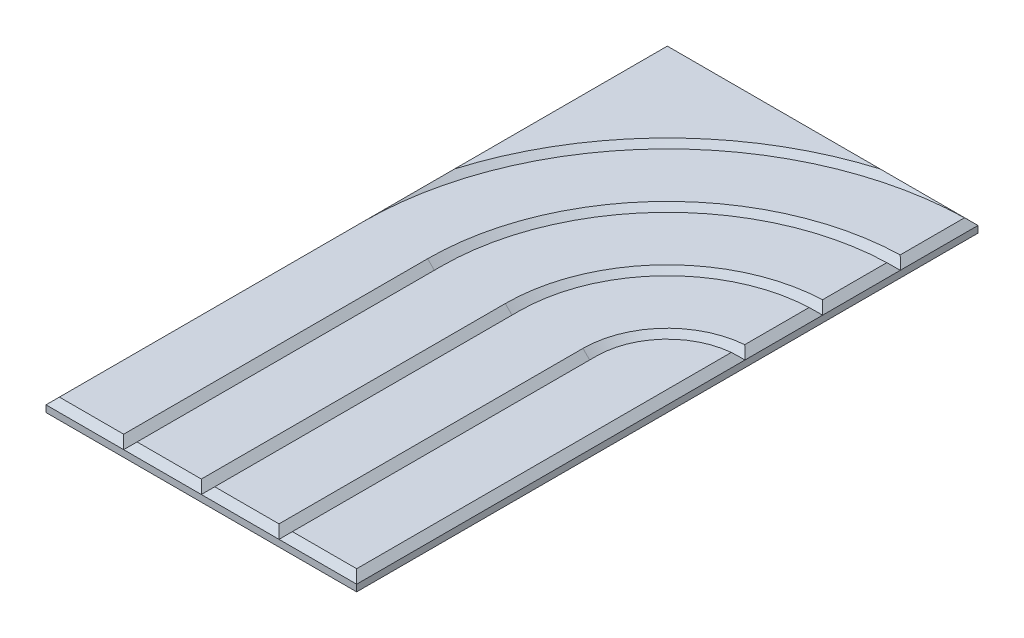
ISO-10303-21;
HEADER;
FILE_DESCRIPTION(('STEP AP214'),'2;1');
FILE_NAME('part.step','',(''),(''),'','','');
FILE_SCHEMA(('AUTOMOTIVE_DESIGN { 1 0 10303 214 1 1 1 1 }'));
ENDSEC;
DATA;
#1=APPLICATION_CONTEXT('core data for automotive mechanical design processes');
#2=APPLICATION_PROTOCOL_DEFINITION('international standard','automotive_design',2000,#1);
#3=PRODUCT_CONTEXT('',#1,'mechanical');
#4=PRODUCT('Part','Part','',(#3));
#5=PRODUCT_RELATED_PRODUCT_CATEGORY('part','',(#4));
#6=PRODUCT_DEFINITION_FORMATION('','',#4);
#7=PRODUCT_DEFINITION_CONTEXT('part definition',#1,'design');
#8=PRODUCT_DEFINITION('design','',#6,#7);
#9=PRODUCT_DEFINITION_SHAPE('','',#8);
#10=(LENGTH_UNIT() NAMED_UNIT(*) SI_UNIT(.MILLI.,.METRE.));
#11=(NAMED_UNIT(*) PLANE_ANGLE_UNIT() SI_UNIT($,.RADIAN.));
#12=(NAMED_UNIT(*) SI_UNIT($,.STERADIAN.) SOLID_ANGLE_UNIT());
#13=UNCERTAINTY_MEASURE_WITH_UNIT(LENGTH_MEASURE(1.E-05),#10,'distance_accuracy_value','');
#14=(GEOMETRIC_REPRESENTATION_CONTEXT(3) GLOBAL_UNCERTAINTY_ASSIGNED_CONTEXT((#13)) GLOBAL_UNIT_ASSIGNED_CONTEXT((#10,
#11,#12)) REPRESENTATION_CONTEXT('',''));
#15=CARTESIAN_POINT('',(0.,0.,0.));
#16=DIRECTION('',(0.,0.,1.));
#17=DIRECTION('',(1.,0.,0.));
#18=AXIS2_PLACEMENT_3D('',#15,#16,#17);
#19=CARTESIAN_POINT('',(290.,25.,580.));
#20=DIRECTION('',(-1.,0.,0.));
#21=DIRECTION('',(0.,0.,1.));
#22=AXIS2_PLACEMENT_3D('',#19,#20,#21);
#23=PLANE('',#22);
#24=DIRECTION('',(0.,-1.,0.));
#25=VECTOR('',#24,1.);
#26=CARTESIAN_POINT('',(290.,25.,-580.));
#27=LINE('',#26,#25);
#28=CARTESIAN_POINT('',(289.999991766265,12.5,-580.));
#29=VERTEX_POINT('',#28);
#30=CARTESIAN_POINT('',(290.,0.,-580.));
#31=VERTEX_POINT('',#30);
#32=EDGE_CURVE('E66',#29,#31,#27,.T.);
#33=ORIENTED_EDGE('',*,*,#32,.F.);
#34=DIRECTION('',(0.,0.,1.));
#35=VECTOR('',#34,1.);
#36=CARTESIAN_POINT('',(290.,12.4999999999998,580.));
#37=LINE('',#36,#35);
#38=CARTESIAN_POINT('',(290.,12.5,-435.));
#39=VERTEX_POINT('',#38);
#40=EDGE_CURVE('E269',#29,#39,#37,.T.);
#41=ORIENTED_EDGE('',*,*,#40,.T.);
#42=DIRECTION('',(0.,0.,1.));
#43=VECTOR('',#42,1.);
#44=CARTESIAN_POINT('',(290.,12.4999999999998,580.));
#45=LINE('',#44,#43);
#46=CARTESIAN_POINT('',(290.,12.5,-290.));
#47=VERTEX_POINT('',#46);
#48=EDGE_CURVE('E270',#39,#47,#45,.T.);
#49=ORIENTED_EDGE('',*,*,#48,.T.);
#50=DIRECTION('',(0.,0.,1.));
#51=VECTOR('',#50,1.);
#52=CARTESIAN_POINT('',(290.,12.4999999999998,580.));
#53=LINE('',#52,#51);
#54=CARTESIAN_POINT('',(290.,12.5,-145.));
#55=VERTEX_POINT('',#54);
#56=EDGE_CURVE('E442',#47,#55,#53,.T.);
#57=ORIENTED_EDGE('',*,*,#56,.T.);
#58=DIRECTION('',(0.,0.,1.));
#59=VECTOR('',#58,1.);
#60=CARTESIAN_POINT('',(290.,12.4999999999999,580.));
#61=LINE('',#60,#59);
#62=CARTESIAN_POINT('',(290.,12.4999999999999,580.));
#63=VERTEX_POINT('',#62);
#64=EDGE_CURVE('E131',#55,#63,#61,.T.);
#65=ORIENTED_EDGE('',*,*,#64,.T.);
#66=DIRECTION('',(0.,-1.,0.));
#67=VECTOR('',#66,1.);
#68=CARTESIAN_POINT('',(290.,25.,580.));
#69=LINE('',#68,#67);
#70=CARTESIAN_POINT('',(290.,0.,580.));
#71=VERTEX_POINT('',#70);
#72=EDGE_CURVE('E418',#63,#71,#69,.T.);
#73=ORIENTED_EDGE('',*,*,#72,.T.);
#74=DIRECTION('',(0.,0.,-1.));
#75=VECTOR('',#74,1.);
#76=CARTESIAN_POINT('',(290.,0.,580.));
#77=LINE('',#76,#75);
#78=EDGE_CURVE('E404',#71,#31,#77,.T.);
#79=ORIENTED_EDGE('',*,*,#78,.T.);
#80=EDGE_LOOP('',(#33,#41,#49,#57,#65,#73,#79));
#81=FACE_BOUND('',#80,.T.);
#82=ADVANCED_FACE('F33',(#81),#23,.F.);
#83=CARTESIAN_POINT('',(0.,25.,0.));
#84=DIRECTION('',(0.,-1.,0.));
#85=DIRECTION('',(0.,0.,-1.));
#86=AXIS2_PLACEMENT_3D('',#83,#84,#85);
#87=PLANE('',#86);
#88=DIRECTION('',(1.,0.,0.));
#89=VECTOR('',#88,1.);
#90=CARTESIAN_POINT('',(0.,25.,567.5));
#91=LINE('',#90,#89);
#92=CARTESIAN_POINT('',(157.5,25.,567.5));
#93=VERTEX_POINT('',#92);
#94=CARTESIAN_POINT('',(277.5,25.,567.5));
#95=VERTEX_POINT('',#94);
#96=EDGE_CURVE('E52',#93,#95,#91,.T.);
#97=ORIENTED_EDGE('',*,*,#96,.T.);
#98=DIRECTION('',(0.,0.,-1.));
#99=VECTOR('',#98,1.);
#100=CARTESIAN_POINT('',(277.5,25.,0.));
#101=LINE('',#100,#99);
#102=CARTESIAN_POINT('',(277.5,25.0000000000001,-131.909059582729));
#103=VERTEX_POINT('',#102);
#104=EDGE_CURVE('E129',#95,#103,#101,.T.);
#105=ORIENTED_EDGE('',*,*,#104,.T.);
#106=CARTESIAN_POINT('',(290.,25.0000000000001,1.11022302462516E-13));
#107=DIRECTION('',(0.,-1.,0.));
#108=DIRECTION('',(0.,0.,-1.));
#109=AXIS2_PLACEMENT_3D('',#106,#107,#108);
#110=CIRCLE('',#109,132.5);
#111=CARTESIAN_POINT('',(157.5,25.0000000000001,2.22044604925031E-13));
#112=VERTEX_POINT('',#111);
#113=EDGE_CURVE('E141',#112,#103,#110,.T.);
#114=ORIENTED_EDGE('',*,*,#113,.F.);
#115=DIRECTION('',(0.,0.,1.));
#116=VECTOR('',#115,1.);
#117=CARTESIAN_POINT('',(157.5,25.0000000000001,2.22044604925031E-13));
#118=LINE('',#117,#116);
#119=EDGE_CURVE('E522',#112,#93,#118,.T.);
#120=ORIENTED_EDGE('',*,*,#119,.T.);
#121=EDGE_LOOP('',(#97,#105,#114,#120));
#122=FACE_BOUND('',#121,.T.);
#123=ADVANCED_FACE('F139',(#122),#87,.F.);
#124=CARTESIAN_POINT('',(290.,25.0000000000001,1.11022302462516E-13));
#125=DIRECTION('',(0.,-1.,0.));
#126=DIRECTION('',(0.,0.,-1.));
#127=AXIS2_PLACEMENT_3D('',#124,#125,#126);
#128=CIRCLE('',#127,157.5);
#129=CARTESIAN_POINT('',(132.5,25.0000000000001,2.22044604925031E-13));
#130=VERTEX_POINT('',#129);
#131=CARTESIAN_POINT('',(277.5,25.0000000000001,-157.003184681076));
#132=VERTEX_POINT('',#131);
#133=EDGE_CURVE('E154',#130,#132,#128,.T.);
#134=ORIENTED_EDGE('',*,*,#133,.T.);
#135=DIRECTION('',(0.,0.,-1.));
#136=VECTOR('',#135,1.);
#137=CARTESIAN_POINT('',(277.5,25.,0.));
#138=LINE('',#137,#136);
#139=CARTESIAN_POINT('',(277.5,25.0000000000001,-277.218325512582));
#140=VERTEX_POINT('',#139);
#141=EDGE_CURVE('E324',#132,#140,#138,.T.);
#142=ORIENTED_EDGE('',*,*,#141,.T.);
#143=CARTESIAN_POINT('',(290.,25.0000000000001,1.11022302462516E-13));
#144=DIRECTION('',(0.,-1.,0.));
#145=DIRECTION('',(0.,0.,-1.));
#146=AXIS2_PLACEMENT_3D('',#143,#144,#145);
#147=CIRCLE('',#146,277.5);
#148=CARTESIAN_POINT('',(12.4999999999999,25.0000000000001,2.22044604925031E-13));
#149=VERTEX_POINT('',#148);
#150=EDGE_CURVE('E175',#149,#140,#147,.T.);
#151=ORIENTED_EDGE('',*,*,#150,.F.);
#152=DIRECTION('',(0.,0.,1.));
#153=VECTOR('',#152,1.);
#154=CARTESIAN_POINT('',(12.4999999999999,25.0000000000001,2.22044604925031E-13));
#155=LINE('',#154,#153);
#156=CARTESIAN_POINT('',(12.5,25.0000000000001,567.5));
#157=VERTEX_POINT('',#156);
#158=EDGE_CURVE('E161',#149,#157,#155,.T.);
#159=ORIENTED_EDGE('',*,*,#158,.T.);
#160=DIRECTION('',(1.,0.,0.));
#161=VECTOR('',#160,1.);
#162=CARTESIAN_POINT('',(0.,25.,567.5));
#163=LINE('',#162,#161);
#164=CARTESIAN_POINT('',(132.5,25.0000000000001,567.5));
#165=VERTEX_POINT('',#164);
#166=EDGE_CURVE('E301',#157,#165,#163,.T.);
#167=ORIENTED_EDGE('',*,*,#166,.T.);
#168=DIRECTION('',(0.,0.,1.));
#169=VECTOR('',#168,1.);
#170=CARTESIAN_POINT('',(132.5,25.0000000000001,2.22044604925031E-13));
#171=LINE('',#170,#169);
#172=EDGE_CURVE('E514',#130,#165,#171,.T.);
#173=ORIENTED_EDGE('',*,*,#172,.F.);
#174=EDGE_LOOP('',(#134,#142,#151,#159,#167,#173));
#175=FACE_BOUND('',#174,.T.);
#176=ADVANCED_FACE('F363',(#175),#87,.F.);
#177=CARTESIAN_POINT('',(290.,25.0000000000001,1.11022302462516E-13));
#178=DIRECTION('',(0.,-1.,0.));
#179=DIRECTION('',(0.,0.,-1.));
#180=AXIS2_PLACEMENT_3D('',#177,#178,#179);
#181=CIRCLE('',#180,302.5);
#182=CARTESIAN_POINT('',(-12.5000000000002,25.0000000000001,2.22044604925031E-13));
#183=VERTEX_POINT('',#182);
#184=CARTESIAN_POINT('',(277.5,25.0000000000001,-302.241625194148));
#185=VERTEX_POINT('',#184);
#186=EDGE_CURVE('E164',#183,#185,#181,.T.);
#187=ORIENTED_EDGE('',*,*,#186,.T.);
#188=DIRECTION('',(0.,0.,-1.));
#189=VECTOR('',#188,1.);
#190=CARTESIAN_POINT('',(277.5,25.,0.));
#191=LINE('',#190,#189);
#192=CARTESIAN_POINT('',(277.5,25.0000000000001,-422.315048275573));
#193=VERTEX_POINT('',#192);
#194=EDGE_CURVE('E295',#185,#193,#191,.T.);
#195=ORIENTED_EDGE('',*,*,#194,.T.);
#196=CARTESIAN_POINT('',(290.,25.0000000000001,1.11022302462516E-13));
#197=DIRECTION('',(0.,-1.,0.));
#198=DIRECTION('',(0.,0.,-1.));
#199=AXIS2_PLACEMENT_3D('',#196,#197,#198);
#200=CIRCLE('',#199,422.5);
#201=CARTESIAN_POINT('',(-132.5,25.0000000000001,2.22044604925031E-13));
#202=VERTEX_POINT('',#201);
#203=EDGE_CURVE('E199',#202,#193,#200,.T.);
#204=ORIENTED_EDGE('',*,*,#203,.F.);
#205=DIRECTION('',(0.,0.,1.));
#206=VECTOR('',#205,1.);
#207=CARTESIAN_POINT('',(-132.5,25.0000000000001,2.22044604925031E-13));
#208=LINE('',#207,#206);
#209=CARTESIAN_POINT('',(-132.5,25.,567.5));
#210=VERTEX_POINT('',#209);
#211=EDGE_CURVE('E185',#202,#210,#208,.T.);
#212=ORIENTED_EDGE('',*,*,#211,.T.);
#213=DIRECTION('',(1.,0.,0.));
#214=VECTOR('',#213,1.);
#215=CARTESIAN_POINT('',(0.,25.,567.5));
#216=LINE('',#215,#214);
#217=CARTESIAN_POINT('',(-12.5000000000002,25.0000000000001,567.5));
#218=VERTEX_POINT('',#217);
#219=EDGE_CURVE('E268',#210,#218,#216,.T.);
#220=ORIENTED_EDGE('',*,*,#219,.T.);
#221=DIRECTION('',(0.,0.,1.));
#222=VECTOR('',#221,1.);
#223=CARTESIAN_POINT('',(-12.5000000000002,25.0000000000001,2.22044604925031E-13));
#224=LINE('',#223,#222);
#225=EDGE_CURVE('E160',#183,#218,#224,.T.);
#226=ORIENTED_EDGE('',*,*,#225,.F.);
#227=EDGE_LOOP('',(#187,#195,#204,#212,#220,#226));
#228=FACE_BOUND('',#227,.T.);
#229=ADVANCED_FACE('F750',(#228),#87,.F.);
#230=CARTESIAN_POINT('',(290.,25.0000000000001,1.11022302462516E-13));
#231=DIRECTION('',(0.,-1.,0.));
#232=DIRECTION('',(0.,0.,-1.));
#233=AXIS2_PLACEMENT_3D('',#230,#231,#232);
#234=CIRCLE('',#233,447.5);
#235=CARTESIAN_POINT('',(-157.5,25.0000000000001,2.22044604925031E-13));
#236=VERTEX_POINT('',#235);
#237=CARTESIAN_POINT('',(277.5,25.0000000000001,-447.325384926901));
#238=VERTEX_POINT('',#237);
#239=EDGE_CURVE('E188',#236,#238,#234,.T.);
#240=ORIENTED_EDGE('',*,*,#239,.T.);
#241=DIRECTION('',(0.,0.,-1.));
#242=VECTOR('',#241,1.);
#243=CARTESIAN_POINT('',(277.5,25.,0.));
#244=LINE('',#243,#242);
#245=CARTESIAN_POINT('',(277.5,25.0000000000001,-567.362318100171));
#246=VERTEX_POINT('',#245);
#247=EDGE_CURVE('E488',#238,#246,#244,.T.);
#248=ORIENTED_EDGE('',*,*,#247,.T.);
#249=CARTESIAN_POINT('',(290.,25.0000000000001,1.11022302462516E-13));
#250=DIRECTION('',(0.,-1.,0.));
#251=DIRECTION('',(0.,0.,-1.));
#252=AXIS2_PLACEMENT_3D('',#249,#250,#251);
#253=CIRCLE('',#252,567.5);
#254=CARTESIAN_POINT('',(-277.5,25.0000000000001,2.22044604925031E-13));
#255=VERTEX_POINT('',#254);
#256=EDGE_CURVE('E210',#255,#246,#253,.T.);
#257=ORIENTED_EDGE('',*,*,#256,.F.);
#258=DIRECTION('',(0.,0.,1.));
#259=VECTOR('',#258,1.);
#260=CARTESIAN_POINT('',(-277.5,25.0000000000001,2.22044604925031E-13));
#261=LINE('',#260,#259);
#262=CARTESIAN_POINT('',(-277.5,25.0000000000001,567.5));
#263=VERTEX_POINT('',#262);
#264=EDGE_CURVE('E203',#255,#263,#261,.T.);
#265=ORIENTED_EDGE('',*,*,#264,.T.);
#266=DIRECTION('',(1.,0.,0.));
#267=VECTOR('',#266,1.);
#268=CARTESIAN_POINT('',(0.,25.,567.5));
#269=LINE('',#268,#267);
#270=CARTESIAN_POINT('',(-157.5,25.0000000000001,567.5));
#271=VERTEX_POINT('',#270);
#272=EDGE_CURVE('E490',#263,#271,#269,.T.);
#273=ORIENTED_EDGE('',*,*,#272,.T.);
#274=DIRECTION('',(0.,0.,1.));
#275=VECTOR('',#274,1.);
#276=CARTESIAN_POINT('',(-157.5,25.0000000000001,2.22044604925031E-13));
#277=LINE('',#276,#275);
#278=EDGE_CURVE('E184',#236,#271,#277,.T.);
#279=ORIENTED_EDGE('',*,*,#278,.F.);
#280=EDGE_LOOP('',(#240,#248,#257,#265,#273,#279));
#281=FACE_BOUND('',#280,.T.);
#282=ADVANCED_FACE('F371',(#281),#87,.F.);
#283=CARTESIAN_POINT('',(-290.,25.,-580.));
#284=DIRECTION('',(0.,0.,1.));
#285=DIRECTION('',(1.,0.,0.));
#286=AXIS2_PLACEMENT_3D('',#283,#284,#285);
#287=PLANE('',#286);
#288=DIRECTION('',(0.,-1.,0.));
#289=VECTOR('',#288,1.);
#290=CARTESIAN_POINT('',(-290.,25.,-580.));
#291=LINE('',#290,#289);
#292=CARTESIAN_POINT('',(-290.,12.4999999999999,-580.));
#293=VERTEX_POINT('',#292);
#294=CARTESIAN_POINT('',(-290.,0.,-580.));
#295=VERTEX_POINT('',#294);
#296=EDGE_CURVE('E423',#293,#295,#291,.T.);
#297=ORIENTED_EDGE('',*,*,#296,.F.);
#298=DIRECTION('',(1.,0.,0.));
#299=VECTOR('',#298,1.);
#300=CARTESIAN_POINT('',(-290.,12.4999999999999,-580.));
#301=LINE('',#300,#299);
#302=EDGE_CURVE('E436',#293,#29,#301,.T.);
#303=ORIENTED_EDGE('',*,*,#302,.T.);
#304=ORIENTED_EDGE('',*,*,#32,.T.);
#305=DIRECTION('',(-1.,0.,0.));
#306=VECTOR('',#305,1.);
#307=CARTESIAN_POINT('',(-290.,0.,-580.));
#308=LINE('',#307,#306);
#309=EDGE_CURVE('E405',#31,#295,#308,.T.);
#310=ORIENTED_EDGE('',*,*,#309,.T.);
#311=EDGE_LOOP('',(#297,#303,#304,#310));
#312=FACE_BOUND('',#311,.T.);
#313=ADVANCED_FACE('F367',(#312),#287,.F.);
#314=CARTESIAN_POINT('',(-290.,25.,580.));
#315=DIRECTION('',(1.,0.,0.));
#316=DIRECTION('',(0.,0.,-1.));
#317=AXIS2_PLACEMENT_3D('',#314,#315,#316);
#318=PLANE('',#317);
#319=DIRECTION('',(0.,0.,1.));
#320=VECTOR('',#319,1.);
#321=CARTESIAN_POINT('',(-290.,12.5,2.22044604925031E-13));
#322=LINE('',#321,#320);
#323=CARTESIAN_POINT('',(-290.,12.5,-8.23344728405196E-06));
#324=VERTEX_POINT('',#323);
#325=CARTESIAN_POINT('',(-290.,12.5,580.));
#326=VERTEX_POINT('',#325);
#327=EDGE_CURVE('E207',#324,#326,#322,.T.);
#328=ORIENTED_EDGE('',*,*,#327,.F.);
#329=DIRECTION('',(0.,0.,-1.));
#330=VECTOR('',#329,1.);
#331=CARTESIAN_POINT('',(-290.,12.4999999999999,580.));
#332=LINE('',#331,#330);
#333=EDGE_CURVE('E571',#324,#293,#332,.T.);
#334=ORIENTED_EDGE('',*,*,#333,.T.);
#335=ORIENTED_EDGE('',*,*,#296,.T.);
#336=DIRECTION('',(0.,0.,1.));
#337=VECTOR('',#336,1.);
#338=CARTESIAN_POINT('',(-290.,0.,580.));
#339=LINE('',#338,#337);
#340=CARTESIAN_POINT('',(-290.,0.,580.));
#341=VERTEX_POINT('',#340);
#342=EDGE_CURVE('E410',#295,#341,#339,.T.);
#343=ORIENTED_EDGE('',*,*,#342,.T.);
#344=DIRECTION('',(0.,-1.,0.));
#345=VECTOR('',#344,1.);
#346=CARTESIAN_POINT('',(-290.,25.,580.));
#347=LINE('',#346,#345);
#348=EDGE_CURVE('E420',#326,#341,#347,.T.);
#349=ORIENTED_EDGE('',*,*,#348,.F.);
#350=EDGE_LOOP('',(#328,#334,#335,#343,#349));
#351=FACE_BOUND('',#350,.T.);
#352=ADVANCED_FACE('F370',(#351),#318,.F.);
#353=DIRECTION('',(-1.,0.,0.));
#354=VECTOR('',#353,1.);
#355=CARTESIAN_POINT('',(0.,25.,-567.5));
#356=LINE('',#355,#354);
#357=CARTESIAN_POINT('',(119.706136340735,25.,-567.5));
#358=VERTEX_POINT('',#357);
#359=CARTESIAN_POINT('',(-277.5,25.,-567.5));
#360=VERTEX_POINT('',#359);
#361=EDGE_CURVE('E78',#358,#360,#356,.T.);
#362=ORIENTED_EDGE('',*,*,#361,.T.);
#363=DIRECTION('',(0.,0.,1.));
#364=VECTOR('',#363,1.);
#365=CARTESIAN_POINT('',(-277.5,25.,0.));
#366=LINE('',#365,#364);
#367=CARTESIAN_POINT('',(-277.5,25.,-170.293863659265));
#368=VERTEX_POINT('',#367);
#369=EDGE_CURVE('E216',#360,#368,#366,.T.);
#370=ORIENTED_EDGE('',*,*,#369,.T.);
#371=CARTESIAN_POINT('',(290.,25.,1.11022302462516E-13));
#372=DIRECTION('',(0.,-1.,0.));
#373=DIRECTION('',(0.,0.,-1.));
#374=AXIS2_PLACEMENT_3D('',#371,#372,#373);
#375=CIRCLE('',#374,592.5);
#376=EDGE_CURVE('E426',#358,#368,#375,.F.);
#377=ORIENTED_EDGE('',*,*,#376,.F.);
#378=EDGE_LOOP('',(#362,#370,#377));
#379=FACE_BOUND('',#378,.T.);
#380=ADVANCED_FACE('F365',(#379),#87,.F.);
#381=CARTESIAN_POINT('',(-290.,25.,580.));
#382=DIRECTION('',(0.,0.,-1.));
#383=DIRECTION('',(-1.,0.,0.));
#384=AXIS2_PLACEMENT_3D('',#381,#382,#383);
#385=PLANE('',#384);
#386=ORIENTED_EDGE('',*,*,#72,.F.);
#387=DIRECTION('',(-1.,0.,0.));
#388=VECTOR('',#387,1.);
#389=CARTESIAN_POINT('',(-290.,12.4999999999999,580.));
#390=LINE('',#389,#388);
#391=CARTESIAN_POINT('',(145.,12.5,580.));
#392=VERTEX_POINT('',#391);
#393=EDGE_CURVE('E461',#63,#392,#390,.T.);
#394=ORIENTED_EDGE('',*,*,#393,.T.);
#395=DIRECTION('',(-1.,0.,0.));
#396=VECTOR('',#395,1.);
#397=CARTESIAN_POINT('',(-290.,12.4999999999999,580.));
#398=LINE('',#397,#396);
#399=CARTESIAN_POINT('',(0.,12.5,580.));
#400=VERTEX_POINT('',#399);
#401=EDGE_CURVE('E468',#392,#400,#398,.T.);
#402=ORIENTED_EDGE('',*,*,#401,.T.);
#403=DIRECTION('',(-1.,0.,0.));
#404=VECTOR('',#403,1.);
#405=CARTESIAN_POINT('',(-290.,12.4999999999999,580.));
#406=LINE('',#405,#404);
#407=CARTESIAN_POINT('',(-145.,12.5,580.));
#408=VERTEX_POINT('',#407);
#409=EDGE_CURVE('E472',#400,#408,#406,.T.);
#410=ORIENTED_EDGE('',*,*,#409,.T.);
#411=DIRECTION('',(-1.,0.,0.));
#412=VECTOR('',#411,1.);
#413=CARTESIAN_POINT('',(-290.,12.4999999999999,580.));
#414=LINE('',#413,#412);
#415=EDGE_CURVE('E136',#408,#326,#414,.T.);
#416=ORIENTED_EDGE('',*,*,#415,.T.);
#417=ORIENTED_EDGE('',*,*,#348,.T.);
#418=DIRECTION('',(1.,0.,0.));
#419=VECTOR('',#418,1.);
#420=CARTESIAN_POINT('',(-290.,0.,580.));
#421=LINE('',#420,#419);
#422=EDGE_CURVE('E415',#341,#71,#421,.T.);
#423=ORIENTED_EDGE('',*,*,#422,.T.);
#424=EDGE_LOOP('',(#386,#394,#402,#410,#416,#417,#423));
#425=FACE_BOUND('',#424,.T.);
#426=ADVANCED_FACE('F376',(#425),#385,.F.);
#427=CARTESIAN_POINT('',(0.,0.,0.));
#428=DIRECTION('',(0.,-1.,0.));
#429=DIRECTION('',(0.,0.,-1.));
#430=AXIS2_PLACEMENT_3D('',#427,#428,#429);
#431=PLANE('',#430);
#432=ORIENTED_EDGE('',*,*,#78,.F.);
#433=ORIENTED_EDGE('',*,*,#422,.F.);
#434=ORIENTED_EDGE('',*,*,#342,.F.);
#435=ORIENTED_EDGE('',*,*,#309,.F.);
#436=EDGE_LOOP('',(#432,#433,#434,#435));
#437=FACE_BOUND('',#436,.T.);
#438=ADVANCED_FACE('F379',(#437),#431,.T.);
#439=CARTESIAN_POINT('',(290.,25.0000000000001,1.11022302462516E-13));
#440=DIRECTION('',(0.,1.,0.));
#441=DIRECTION('',(0.,0.,1.));
#442=AXIS2_PLACEMENT_3D('',#439,#440,#441);
#443=CONICAL_SURFACE('',#442,592.5,0.785398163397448);
#444=ORIENTED_EDGE('',*,*,#376,.T.);
#445=CARTESIAN_POINT('',(-277.5,25.,-170.293863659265));
#446=CARTESIAN_POINT('',(-278.014249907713,24.4857500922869,-166.790929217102));
#447=CARTESIAN_POINT('',(-278.513280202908,23.9867197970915,-163.283561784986));
#448=CARTESIAN_POINT('',(-279.480617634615,23.0193823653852,-156.260353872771));
#449=CARTESIAN_POINT('',(-279.948924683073,22.551075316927,-152.744513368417));
#450=CARTESIAN_POINT('',(-281.307329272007,21.192670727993,-142.184913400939));
#451=CARTESIAN_POINT('',(-282.150911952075,20.3490880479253,-135.12906394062));
#452=CARTESIAN_POINT('',(-283.709806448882,18.7901935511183,-121.00813943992));
#453=CARTESIAN_POINT('',(-284.425449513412,18.0745504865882,-113.943137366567));
#454=CARTESIAN_POINT('',(-285.729353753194,16.7706462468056,-99.789669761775));
#455=CARTESIAN_POINT('',(-286.317615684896,16.1823843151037,-92.7012043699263));
#456=CARTESIAN_POINT('',(-287.365263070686,15.1347369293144,-78.5046441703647));
#457=CARTESIAN_POINT('',(-287.824637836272,14.6753621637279,-71.3965477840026));
#458=CARTESIAN_POINT('',(-288.613225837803,13.8867741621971,-57.1659372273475));
#459=CARTESIAN_POINT('',(-288.942438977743,13.5575610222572,-50.0434230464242));
#460=CARTESIAN_POINT('',(-289.47050950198,13.0294904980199,-35.7698590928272));
#461=CARTESIAN_POINT('',(-289.669021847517,12.8309781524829,-28.6187835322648));
#462=CARTESIAN_POINT('',(-289.867582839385,12.632417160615,-17.8886470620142));
#463=CARTESIAN_POINT('',(-289.917235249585,12.5827647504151,-14.3112969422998));
#464=CARTESIAN_POINT('',(-289.98344490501,12.5165550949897,-7.1559824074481));
#465=CARTESIAN_POINT('',(-290.000002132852,12.499997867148,-3.57801799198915));
#466=CARTESIAN_POINT('',(-290.,12.5,-1.14668947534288E-05));
#467=B_SPLINE_CURVE_WITH_KNOTS('',3,(#445,#446,#447,#448,#449,#450,#451,#452,#453,#454,#455,
#456,#457,#458,#459,#460,#461,#462,#463,#464,#465,#466),.UNSPECIFIED.,.F.,.F.,(4,2,2,2,2,2,2,2,
2,2,4),(0.,10.7327584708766,21.465547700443,42.9310908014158,64.340226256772,85.7492345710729,
107.160017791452,128.570816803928,150.037914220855,160.771767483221,171.505626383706),.UNSPECIFIED.);
#468=EDGE_CURVE('E221',#368,#324,#467,.T.);
#469=ORIENTED_EDGE('',*,*,#468,.T.);
#470=CARTESIAN_POINT('',(290.,12.5,1.11022302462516E-13));
#471=DIRECTION('',(0.,-1.,0.));
#472=DIRECTION('',(0.,0.,-1.));
#473=AXIS2_PLACEMENT_3D('',#470,#471,#472);
#474=CIRCLE('',#473,580.);
#475=EDGE_CURVE('E206',#324,#29,#474,.T.);
#476=ORIENTED_EDGE('',*,*,#475,.T.);
#477=CARTESIAN_POINT('',(289.999988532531,12.4999999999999,-580.));
#478=CARTESIAN_POINT('',(286.421982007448,12.4999978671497,-580.00000213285));
#479=CARTESIAN_POINT('',(282.844017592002,12.5165550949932,-579.983444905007));
#480=CARTESIAN_POINT('',(275.688703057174,12.5827647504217,-579.917235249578));
#481=CARTESIAN_POINT('',(272.111352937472,12.632417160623,-579.867582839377));
#482=CARTESIAN_POINT('',(261.381216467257,12.8309781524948,-579.669021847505));
#483=CARTESIAN_POINT('',(254.230140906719,13.029490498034,-579.470509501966));
#484=CARTESIAN_POINT('',(239.95657695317,13.5575610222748,-578.942438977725));
#485=CARTESIAN_POINT('',(232.834062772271,13.886774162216,-578.613225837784));
#486=CARTESIAN_POINT('',(218.603452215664,14.6753621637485,-577.824637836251));
#487=CARTESIAN_POINT('',(211.495355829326,15.1347369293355,-577.365263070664));
#488=CARTESIAN_POINT('',(197.298795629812,16.1823843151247,-576.317615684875));
#489=CARTESIAN_POINT('',(190.210330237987,16.7706462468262,-575.729353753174));
#490=CARTESIAN_POINT('',(176.056862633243,18.074550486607,-574.425449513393));
#491=CARTESIAN_POINT('',(168.991860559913,18.7901935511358,-573.709806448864));
#492=CARTESIAN_POINT('',(154.870936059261,20.3490880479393,-572.15091195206));
#493=CARTESIAN_POINT('',(147.815086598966,21.1926707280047,-571.307329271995));
#494=CARTESIAN_POINT('',(137.255486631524,22.5510753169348,-569.948924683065));
#495=CARTESIAN_POINT('',(133.739646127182,23.0193823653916,-569.480617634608));
#496=CARTESIAN_POINT('',(126.71643821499,23.9867197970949,-568.513280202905));
#497=CARTESIAN_POINT('',(123.209070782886,24.4857500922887,-568.014249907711));
#498=CARTESIAN_POINT('',(119.706136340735,25.,-567.5));
#499=B_SPLINE_CURVE_WITH_KNOTS('',3,(#477,#478,#479,#480,#481,#482,#483,#484,#485,#486,#487,
#488,#489,#490,#491,#492,#493,#494,#495,#496,#497,#498),.UNSPECIFIED.,.F.,.F.,(4,2,2,2,2,2,2,2,
2,2,4),(0.,10.7338589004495,21.4677121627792,42.9348095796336,64.3456085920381,85.7563918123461,
107.165400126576,128.57453558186,150.040078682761,160.772867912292,171.505626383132),.UNSPECIFIED.);
#500=EDGE_CURVE('E218',#29,#358,#499,.T.);
#501=ORIENTED_EDGE('',*,*,#500,.T.);
#502=EDGE_LOOP('',(#444,#469,#476,#501));
#503=FACE_BOUND('',#502,.T.);
#504=ADVANCED_FACE('F230',(#503),#443,.F.);
#505=CARTESIAN_POINT('',(290.,12.5,1.11022302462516E-13));
#506=DIRECTION('',(0.,-1.,0.));
#507=DIRECTION('',(0.,0.,-1.));
#508=AXIS2_PLACEMENT_3D('',#505,#506,#507);
#509=CONICAL_SURFACE('',#508,580.,0.785398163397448);
#510=ORIENTED_EDGE('',*,*,#256,.T.);
#511=CARTESIAN_POINT('',(277.5,25.,-567.362318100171));
#512=CARTESIAN_POINT('',(278.537751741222,23.9622482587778,-568.423185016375));
#513=CARTESIAN_POINT('',(279.576502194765,22.9234978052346,-569.482097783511));
#514=CARTESIAN_POINT('',(281.655964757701,20.8440352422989,-571.59604298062));
#515=CARTESIAN_POINT('',(282.696676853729,19.8033231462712,-572.651075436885));
#516=CARTESIAN_POINT('',(284.780040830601,17.719959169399,-574.757302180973));
#517=CARTESIAN_POINT('',(285.822692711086,16.6773072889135,-575.808496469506));
#518=CARTESIAN_POINT('',(287.909915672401,14.5900843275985,-577.907088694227));
#519=CARTESIAN_POINT('',(288.954486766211,13.5455132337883,-578.954486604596));
#520=CARTESIAN_POINT('',(290.,12.4999999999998,-580.));
#521=B_SPLINE_CURVE_WITH_KNOTS('',3,(#511,#512,#513,#514,#515,#516,#517,#518,#519,#520),
.UNSPECIFIED.,.F.,.F.,(4,2,2,2,4),(0.,5.4326461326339,10.8652553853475,16.2978636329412,
21.730508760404),.UNSPECIFIED.);
#522=EDGE_CURVE('E398',#246,#29,#521,.T.);
#523=ORIENTED_EDGE('',*,*,#522,.T.);
#524=ORIENTED_EDGE('',*,*,#475,.F.);
#525=DIRECTION('',(0.707106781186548,0.707106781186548,0.));
#526=VECTOR('',#525,1.);
#527=CARTESIAN_POINT('',(-277.5,25.0000000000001,2.22044604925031E-13));
#528=LINE('',#527,#526);
#529=EDGE_CURVE('E202',#324,#255,#528,.T.);
#530=ORIENTED_EDGE('',*,*,#529,.T.);
#531=EDGE_LOOP('',(#510,#523,#524,#530));
#532=FACE_BOUND('',#531,.T.);
#533=ADVANCED_FACE('F384',(#532),#509,.T.);
#534=CARTESIAN_POINT('',(-277.5,25.0000000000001,2.22044604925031E-13));
#535=DIRECTION('',(0.707106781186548,-0.707106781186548,0.));
#536=DIRECTION('',(0.707106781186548,0.707106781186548,0.));
#537=AXIS2_PLACEMENT_3D('',#534,#535,#536);
#538=PLANE('',#537);
#539=ORIENTED_EDGE('',*,*,#327,.T.);
#540=DIRECTION('',(-0.577350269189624,-0.577350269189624,0.577350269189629));
#541=VECTOR('',#540,1.);
#542=CARTESIAN_POINT('',(-185.000000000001,117.499999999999,475.));
#543=LINE('',#542,#541);
#544=EDGE_CURVE('E11',#326,#263,#543,.F.);
#545=ORIENTED_EDGE('',*,*,#544,.T.);
#546=ORIENTED_EDGE('',*,*,#264,.F.);
#547=ORIENTED_EDGE('',*,*,#529,.F.);
#548=EDGE_LOOP('',(#539,#545,#546,#547));
#549=FACE_BOUND('',#548,.T.);
#550=ADVANCED_FACE('F285',(#549),#538,.F.);
#551=CARTESIAN_POINT('',(290.,12.5,1.11022302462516E-13));
#552=DIRECTION('',(0.,-1.,0.));
#553=DIRECTION('',(0.,0.,-1.));
#554=AXIS2_PLACEMENT_3D('',#551,#552,#553);
#555=CONICAL_SURFACE('',#554,435.,0.785398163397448);
#556=ORIENTED_EDGE('',*,*,#203,.T.);
#557=CARTESIAN_POINT('',(277.5,25.,-422.315048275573));
#558=CARTESIAN_POINT('',(278.536365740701,23.9636342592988,-423.382542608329));
#559=CARTESIAN_POINT('',(279.574093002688,22.9259069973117,-424.44739270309));
#560=CARTESIAN_POINT('',(281.652205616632,20.8477943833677,-426.571854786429));
#561=CARTESIAN_POINT('',(282.692590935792,19.8074090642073,-427.631466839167));
#562=CARTESIAN_POINT('',(284.775979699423,17.7240203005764,-429.745528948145));
#563=CARTESIAN_POINT('',(285.818983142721,16.6810168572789,-430.799979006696));
#564=CARTESIAN_POINT('',(287.907571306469,14.5924286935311,-432.903792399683));
#565=CARTESIAN_POINT('',(288.953156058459,13.546843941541,-433.953155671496));
#566=CARTESIAN_POINT('',(290.,12.4999999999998,-435.));
#567=B_SPLINE_CURVE_WITH_KNOTS('',3,(#557,#558,#559,#560,#561,#562,#563,#564,#565,#566),
.UNSPECIFIED.,.F.,.F.,(4,2,2,2,4),(0.,5.43956163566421,10.8790564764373,16.3185488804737,
21.7581080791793),.UNSPECIFIED.);
#568=EDGE_CURVE('E288',#193,#39,#567,.T.);
#569=ORIENTED_EDGE('',*,*,#568,.T.);
#570=CARTESIAN_POINT('',(290.,12.5,1.11022302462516E-13));
#571=DIRECTION('',(0.,-1.,0.));
#572=DIRECTION('',(0.,0.,-1.));
#573=AXIS2_PLACEMENT_3D('',#570,#571,#572);
#574=CIRCLE('',#573,435.);
#575=CARTESIAN_POINT('',(-145.,12.5,2.22044604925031E-13));
#576=VERTEX_POINT('',#575);
#577=EDGE_CURVE('E196',#576,#39,#574,.T.);
#578=ORIENTED_EDGE('',*,*,#577,.F.);
#579=DIRECTION('',(0.707106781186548,0.707106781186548,0.));
#580=VECTOR('',#579,1.);
#581=CARTESIAN_POINT('',(-132.5,25.0000000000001,2.22044604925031E-13));
#582=LINE('',#581,#580);
#583=EDGE_CURVE('E181',#576,#202,#582,.T.);
#584=ORIENTED_EDGE('',*,*,#583,.T.);
#585=EDGE_LOOP('',(#556,#569,#578,#584));
#586=FACE_BOUND('',#585,.T.);
#587=ADVANCED_FACE('F279',(#586),#555,.T.);
#588=CARTESIAN_POINT('',(290.,25.0000000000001,1.11022302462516E-13));
#589=DIRECTION('',(0.,1.,0.));
#590=DIRECTION('',(0.,0.,1.));
#591=AXIS2_PLACEMENT_3D('',#588,#589,#590);
#592=CONICAL_SURFACE('',#591,447.5,0.785398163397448);
#593=ORIENTED_EDGE('',*,*,#577,.T.);
#594=CARTESIAN_POINT('',(290.,12.4999999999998,-435.));
#595=CARTESIAN_POINT('',(288.963147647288,13.5368523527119,-436.036851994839));
#596=CARTESIAN_POINT('',(287.925059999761,14.5749400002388,-437.071232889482));
#597=CARTESIAN_POINT('',(285.846470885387,16.6535291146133,-439.135099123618));
#598=CARTESIAN_POINT('',(284.805969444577,17.6940305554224,-440.164584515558));
#599=CARTESIAN_POINT('',(282.722587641,19.7774123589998,-442.218728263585));
#600=CARTESIAN_POINT('',(281.679707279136,20.8202927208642,-443.243386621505));
#601=CARTESIAN_POINT('',(279.591599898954,22.908400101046,-445.28794400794));
#602=CARTESIAN_POINT('',(278.546372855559,23.953627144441,-446.307842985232));
#603=CARTESIAN_POINT('',(277.5,25.,-447.325384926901));
#604=B_SPLINE_CURVE_WITH_KNOTS('',3,(#594,#595,#596,#597,#598,#599,#600,#601,#602,#603),
.UNSPECIFIED.,.F.,.F.,(4,2,2,2,4),(0.,5.387639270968,10.7752206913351,16.1628000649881,
21.5504372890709),.UNSPECIFIED.);
#605=EDGE_CURVE('E261',#39,#238,#604,.T.);
#606=ORIENTED_EDGE('',*,*,#605,.T.);
#607=ORIENTED_EDGE('',*,*,#239,.F.);
#608=DIRECTION('',(0.707106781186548,-0.707106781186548,0.));
#609=VECTOR('',#608,1.);
#610=CARTESIAN_POINT('',(-145.,12.5,2.22044604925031E-13));
#611=LINE('',#610,#609);
#612=EDGE_CURVE('E178',#236,#576,#611,.T.);
#613=ORIENTED_EDGE('',*,*,#612,.T.);
#614=EDGE_LOOP('',(#593,#606,#607,#613));
#615=FACE_BOUND('',#614,.T.);
#616=ADVANCED_FACE('F273',(#615),#592,.F.);
#617=CARTESIAN_POINT('',(-132.5,25.0000000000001,2.22044604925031E-13));
#618=DIRECTION('',(0.707106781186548,-0.707106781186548,0.));
#619=DIRECTION('',(0.707106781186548,0.707106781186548,0.));
#620=AXIS2_PLACEMENT_3D('',#617,#618,#619);
#621=PLANE('',#620);
#622=DIRECTION('',(0.,0.,1.));
#623=VECTOR('',#622,1.);
#624=CARTESIAN_POINT('',(-145.,12.5,2.22044604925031E-13));
#625=LINE('',#624,#623);
#626=EDGE_CURVE('E189',#576,#408,#625,.T.);
#627=ORIENTED_EDGE('',*,*,#626,.T.);
#628=DIRECTION('',(-0.577350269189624,-0.577350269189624,0.577350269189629));
#629=VECTOR('',#628,1.);
#630=CARTESIAN_POINT('',(-88.3333333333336,69.1666666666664,523.333333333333));
#631=LINE('',#630,#629);
#632=EDGE_CURVE('E482',#408,#210,#631,.F.);
#633=ORIENTED_EDGE('',*,*,#632,.T.);
#634=ORIENTED_EDGE('',*,*,#211,.F.);
#635=ORIENTED_EDGE('',*,*,#583,.F.);
#636=EDGE_LOOP('',(#627,#633,#634,#635));
#637=FACE_BOUND('',#636,.T.);
#638=ADVANCED_FACE('F278',(#637),#621,.F.);
#639=CARTESIAN_POINT('',(-145.,12.5,2.22044604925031E-13));
#640=DIRECTION('',(-0.707106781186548,-0.707106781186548,0.));
#641=DIRECTION('',(0.707106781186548,-0.707106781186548,0.));
#642=AXIS2_PLACEMENT_3D('',#639,#640,#641);
#643=PLANE('',#642);
#644=ORIENTED_EDGE('',*,*,#278,.T.);
#645=DIRECTION('',(-0.577350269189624,0.577350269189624,-0.577350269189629));
#646=VECTOR('',#645,1.);
#647=CARTESIAN_POINT('',(-105.,-27.4999999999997,620.));
#648=LINE('',#647,#646);
#649=EDGE_CURVE('E43',#271,#408,#648,.F.);
#650=ORIENTED_EDGE('',*,*,#649,.T.);
#651=ORIENTED_EDGE('',*,*,#626,.F.);
#652=ORIENTED_EDGE('',*,*,#612,.F.);
#653=EDGE_LOOP('',(#644,#650,#651,#652));
#654=FACE_BOUND('',#653,.T.);
#655=ADVANCED_FACE('F281',(#654),#643,.F.);
#656=CARTESIAN_POINT('',(290.,12.5,1.11022302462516E-13));
#657=DIRECTION('',(0.,-1.,0.));
#658=DIRECTION('',(0.,0.,-1.));
#659=AXIS2_PLACEMENT_3D('',#656,#657,#658);
#660=CONICAL_SURFACE('',#659,290.,0.785398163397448);
#661=ORIENTED_EDGE('',*,*,#150,.T.);
#662=CARTESIAN_POINT('',(277.5,25.,-277.218325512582));
#663=CARTESIAN_POINT('',(278.533462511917,23.9665374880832,-278.29943626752));
#664=CARTESIAN_POINT('',(279.569061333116,22.9309386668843,-279.376460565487));
#665=CARTESIAN_POINT('',(281.644379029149,20.855620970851,-281.522452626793));
#666=CARTESIAN_POINT('',(282.68409778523,19.8159022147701,-282.591420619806));
#667=CARTESIAN_POINT('',(284.767560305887,17.7324396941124,-284.721476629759));
#668=CARTESIAN_POINT('',(285.811304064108,16.6886959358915,-285.782564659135));
#669=CARTESIAN_POINT('',(287.902732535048,14.5972674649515,-287.897034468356));
#670=CARTESIAN_POINT('',(288.950417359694,13.5495826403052,-288.950416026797));
#671=CARTESIAN_POINT('',(290.,12.4999999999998,-290.));
#672=B_SPLINE_CURVE_WITH_KNOTS('',3,(#662,#663,#664,#665,#666,#667,#668,#669,#670,#671),
.UNSPECIFIED.,.F.,.F.,(4,2,2,2,4),(0.,5.45379797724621,10.9074398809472,16.3610731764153,
21.8148625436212),.UNSPECIFIED.);
#673=EDGE_CURVE('E317',#140,#47,#672,.T.);
#674=ORIENTED_EDGE('',*,*,#673,.T.);
#675=CARTESIAN_POINT('',(290.,12.5,1.11022302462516E-13));
#676=DIRECTION('',(0.,-1.,0.));
#677=DIRECTION('',(0.,0.,-1.));
#678=AXIS2_PLACEMENT_3D('',#675,#676,#677);
#679=CIRCLE('',#678,290.);
#680=CARTESIAN_POINT('',(-1.66533453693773E-13,12.5,2.22044604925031E-13));
#681=VERTEX_POINT('',#680);
#682=EDGE_CURVE('E172',#681,#47,#679,.T.);
#683=ORIENTED_EDGE('',*,*,#682,.F.);
#684=DIRECTION('',(0.707106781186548,0.707106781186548,0.));
#685=VECTOR('',#684,1.);
#686=CARTESIAN_POINT('',(12.4999999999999,25.0000000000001,2.22044604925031E-13));
#687=LINE('',#686,#685);
#688=EDGE_CURVE('E151',#681,#149,#687,.T.);
#689=ORIENTED_EDGE('',*,*,#688,.T.);
#690=EDGE_LOOP('',(#661,#674,#683,#689));
#691=FACE_BOUND('',#690,.T.);
#692=ADVANCED_FACE('F309',(#691),#660,.T.);
#693=CARTESIAN_POINT('',(290.,25.0000000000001,1.11022302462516E-13));
#694=DIRECTION('',(0.,1.,0.));
#695=DIRECTION('',(0.,0.,1.));
#696=AXIS2_PLACEMENT_3D('',#693,#694,#695);
#697=CONICAL_SURFACE('',#696,302.5,0.785398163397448);
#698=ORIENTED_EDGE('',*,*,#682,.T.);
#699=CARTESIAN_POINT('',(290.,12.4999999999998,-290.));
#700=CARTESIAN_POINT('',(288.96543098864,13.53456901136,-291.034567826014));
#701=CARTESIAN_POINT('',(287.92901793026,14.5709820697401,-292.065445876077));
#702=CARTESIAN_POINT('',(285.852628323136,16.6473716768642,-294.119926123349));
#703=CARTESIAN_POINT('',(284.812651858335,17.6873481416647,-295.14352849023));
#704=CARTESIAN_POINT('',(282.729212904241,19.7707870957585,-297.183608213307));
#705=CARTESIAN_POINT('',(281.685750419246,20.8142495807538,-298.200085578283));
#706=CARTESIAN_POINT('',(279.595408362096,22.9045916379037,-300.22606342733));
#707=CARTESIAN_POINT('',(278.548528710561,23.951471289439,-301.235563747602));
#708=CARTESIAN_POINT('',(277.5,25.,-302.241625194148));
#709=B_SPLINE_CURVE_WITH_KNOTS('',3,(#699,#700,#701,#702,#703,#704,#705,#706,#707,#708),
.UNSPECIFIED.,.F.,.F.,(4,2,2,2,4),(0.,5.37576912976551,10.7514124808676,16.1270492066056,
21.5028117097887),.UNSPECIFIED.);
#710=EDGE_CURVE('E294',#47,#185,#709,.T.);
#711=ORIENTED_EDGE('',*,*,#710,.T.);
#712=ORIENTED_EDGE('',*,*,#186,.F.);
#713=DIRECTION('',(0.707106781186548,-0.707106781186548,0.));
#714=VECTOR('',#713,1.);
#715=CARTESIAN_POINT('',(-1.66533453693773E-13,12.5,2.22044604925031E-13));
#716=LINE('',#715,#714);
#717=EDGE_CURVE('E147',#183,#681,#716,.T.);
#718=ORIENTED_EDGE('',*,*,#717,.T.);
#719=EDGE_LOOP('',(#698,#711,#712,#718));
#720=FACE_BOUND('',#719,.T.);
#721=ADVANCED_FACE('F303',(#720),#697,.F.);
#722=CARTESIAN_POINT('',(12.4999999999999,25.0000000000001,2.22044604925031E-13));
#723=DIRECTION('',(0.707106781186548,-0.707106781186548,0.));
#724=DIRECTION('',(0.707106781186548,0.707106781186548,0.));
#725=AXIS2_PLACEMENT_3D('',#722,#723,#724);
#726=PLANE('',#725);
#727=DIRECTION('',(0.,0.,1.));
#728=VECTOR('',#727,1.);
#729=CARTESIAN_POINT('',(-1.66533453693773E-13,12.5,2.22044604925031E-13));
#730=LINE('',#729,#728);
#731=EDGE_CURVE('E165',#681,#400,#730,.T.);
#732=ORIENTED_EDGE('',*,*,#731,.T.);
#733=DIRECTION('',(-0.577350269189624,-0.577350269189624,0.577350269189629));
#734=VECTOR('',#733,1.);
#735=CARTESIAN_POINT('',(8.33333333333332,20.8333333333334,571.666666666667));
#736=LINE('',#735,#734);
#737=EDGE_CURVE('E477',#400,#157,#736,.F.);
#738=ORIENTED_EDGE('',*,*,#737,.T.);
#739=ORIENTED_EDGE('',*,*,#158,.F.);
#740=ORIENTED_EDGE('',*,*,#688,.F.);
#741=EDGE_LOOP('',(#732,#738,#739,#740));
#742=FACE_BOUND('',#741,.T.);
#743=ADVANCED_FACE('F308',(#742),#726,.F.);
#744=CARTESIAN_POINT('',(-1.66533453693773E-13,12.5,2.22044604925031E-13));
#745=DIRECTION('',(-0.707106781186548,-0.707106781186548,0.));
#746=DIRECTION('',(0.707106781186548,-0.707106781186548,0.));
#747=AXIS2_PLACEMENT_3D('',#744,#745,#746);
#748=PLANE('',#747);
#749=ORIENTED_EDGE('',*,*,#225,.T.);
#750=DIRECTION('',(-0.577350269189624,0.577350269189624,-0.577350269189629));
#751=VECTOR('',#750,1.);
#752=CARTESIAN_POINT('',(-8.3333333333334,20.8333333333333,571.666666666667));
#753=LINE('',#752,#751);
#754=EDGE_CURVE('E479',#218,#400,#753,.F.);
#755=ORIENTED_EDGE('',*,*,#754,.T.);
#756=ORIENTED_EDGE('',*,*,#731,.F.);
#757=ORIENTED_EDGE('',*,*,#717,.F.);
#758=EDGE_LOOP('',(#749,#755,#756,#757));
#759=FACE_BOUND('',#758,.T.);
#760=ADVANCED_FACE('F311',(#759),#748,.F.);
#761=CARTESIAN_POINT('',(290.,12.5,1.11022302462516E-13));
#762=DIRECTION('',(0.,-1.,0.));
#763=DIRECTION('',(0.,0.,-1.));
#764=AXIS2_PLACEMENT_3D('',#761,#762,#763);
#765=CONICAL_SURFACE('',#764,145.,0.785398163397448);
#766=ORIENTED_EDGE('',*,*,#113,.T.);
#767=CARTESIAN_POINT('',(277.5,25.,-131.909059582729));
#768=CARTESIAN_POINT('',(278.523567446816,23.9764325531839,-133.034193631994));
#769=CARTESIAN_POINT('',(279.552050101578,22.9479498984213,-134.150364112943));
#770=CARTESIAN_POINT('',(281.618148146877,20.8818518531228,-136.365282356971));
#771=CARTESIAN_POINT('',(282.655762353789,19.8442376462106,-137.464032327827));
#772=CARTESIAN_POINT('',(284.739672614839,17.7603273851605,-139.644885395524));
#773=CARTESIAN_POINT('',(285.785968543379,16.714031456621,-140.726988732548));
#774=CARTESIAN_POINT('',(287.886892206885,14.6131077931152,-142.875301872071));
#775=CARTESIAN_POINT('',(288.941520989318,13.5584790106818,-143.941509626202));
#776=CARTESIAN_POINT('',(290.,12.4999999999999,-145.));
#777=B_SPLINE_CURVE_WITH_KNOTS('',3,(#767,#768,#769,#770,#771,#772,#773,#774,#775,#776),
.UNSPECIFIED.,.F.,.F.,(4,2,2,2,4),(0.,5.50010722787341,10.9995117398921,16.4988368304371,
21.9988645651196),.UNSPECIFIED.);
#778=EDGE_CURVE('E126',#103,#55,#777,.T.);
#779=ORIENTED_EDGE('',*,*,#778,.T.);
#780=CARTESIAN_POINT('',(290.,12.5,1.11022302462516E-13));
#781=DIRECTION('',(0.,-1.,0.));
#782=DIRECTION('',(0.,0.,-1.));
#783=AXIS2_PLACEMENT_3D('',#780,#781,#782);
#784=CIRCLE('',#783,145.);
#785=CARTESIAN_POINT('',(145.,12.5,2.22044604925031E-13));
#786=VERTEX_POINT('',#785);
#787=EDGE_CURVE('E148',#786,#55,#784,.T.);
#788=ORIENTED_EDGE('',*,*,#787,.F.);
#789=DIRECTION('',(0.707106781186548,0.707106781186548,0.));
#790=VECTOR('',#789,1.);
#791=CARTESIAN_POINT('',(157.5,25.0000000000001,2.22044604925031E-13));
#792=LINE('',#791,#790);
#793=EDGE_CURVE('E146',#786,#112,#792,.T.);
#794=ORIENTED_EDGE('',*,*,#793,.T.);
#795=EDGE_LOOP('',(#766,#779,#788,#794));
#796=FACE_BOUND('',#795,.T.);
#797=ADVANCED_FACE('F144',(#796),#765,.T.);
#798=CARTESIAN_POINT('',(290.,25.0000000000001,1.11022302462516E-13));
#799=DIRECTION('',(0.,1.,0.));
#800=DIRECTION('',(0.,0.,1.));
#801=AXIS2_PLACEMENT_3D('',#798,#799,#800);
#802=CONICAL_SURFACE('',#801,157.5,0.785398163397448);
#803=ORIENTED_EDGE('',*,*,#787,.T.);
#804=CARTESIAN_POINT('',(290.,12.4999999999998,-145.));
#805=CARTESIAN_POINT('',(288.971836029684,13.5281639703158,-146.028154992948));
#806=CARTESIAN_POINT('',(287.940037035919,14.5599629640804,-147.049027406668));
#807=CARTESIAN_POINT('',(285.869632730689,16.6303672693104,-149.07660730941));
#808=CARTESIAN_POINT('',(284.831028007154,17.668971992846,-150.083315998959));
#809=CARTESIAN_POINT('',(282.747309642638,19.7526903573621,-152.083135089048));
#810=CARTESIAN_POINT('',(281.70219605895,20.7978039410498,-153.076245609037));
#811=CARTESIAN_POINT('',(279.605696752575,22.8943032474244,-155.04941409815));
#812=CARTESIAN_POINT('',(278.554310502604,23.9456894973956,-156.029470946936));
#813=CARTESIAN_POINT('',(277.5,25.,-157.003184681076));
#814=B_SPLINE_CURVE_WITH_KNOTS('',3,(#804,#805,#806,#807,#808,#809,#810,#811,#812,#813),
.UNSPECIFIED.,.F.,.F.,(4,2,2,2,4),(0.,5.34244847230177,10.6844413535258,16.0263872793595,
21.3687887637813),.UNSPECIFIED.);
#815=EDGE_CURVE('E323',#55,#132,#814,.T.);
#816=ORIENTED_EDGE('',*,*,#815,.T.);
#817=ORIENTED_EDGE('',*,*,#133,.F.);
#818=DIRECTION('',(0.707106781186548,-0.707106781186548,0.));
#819=VECTOR('',#818,1.);
#820=CARTESIAN_POINT('',(145.,12.5,2.22044604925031E-13));
#821=LINE('',#820,#819);
#822=EDGE_CURVE('E453',#130,#786,#821,.T.);
#823=ORIENTED_EDGE('',*,*,#822,.T.);
#824=EDGE_LOOP('',(#803,#816,#817,#823));
#825=FACE_BOUND('',#824,.T.);
#826=ADVANCED_FACE('F350',(#825),#802,.F.);
#827=CARTESIAN_POINT('',(157.5,25.0000000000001,2.22044604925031E-13));
#828=DIRECTION('',(0.707106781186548,-0.707106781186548,0.));
#829=DIRECTION('',(0.707106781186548,0.707106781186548,0.));
#830=AXIS2_PLACEMENT_3D('',#827,#828,#829);
#831=PLANE('',#830);
#832=DIRECTION('',(0.,0.,1.));
#833=VECTOR('',#832,1.);
#834=CARTESIAN_POINT('',(145.,12.5,2.22044604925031E-13));
#835=LINE('',#834,#833);
#836=EDGE_CURVE('E520',#786,#392,#835,.T.);
#837=ORIENTED_EDGE('',*,*,#836,.T.);
#838=DIRECTION('',(-0.577350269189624,-0.577350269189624,0.577350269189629));
#839=VECTOR('',#838,1.);
#840=CARTESIAN_POINT('',(105.,-27.4999999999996,620.));
#841=LINE('',#840,#839);
#842=EDGE_CURVE('E463',#392,#93,#841,.F.);
#843=ORIENTED_EDGE('',*,*,#842,.T.);
#844=ORIENTED_EDGE('',*,*,#119,.F.);
#845=ORIENTED_EDGE('',*,*,#793,.F.);
#846=EDGE_LOOP('',(#837,#843,#844,#845));
#847=FACE_BOUND('',#846,.T.);
#848=ADVANCED_FACE('F528',(#847),#831,.F.);
#849=CARTESIAN_POINT('',(145.,12.5,2.22044604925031E-13));
#850=DIRECTION('',(-0.707106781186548,-0.707106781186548,0.));
#851=DIRECTION('',(0.707106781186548,-0.707106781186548,0.));
#852=AXIS2_PLACEMENT_3D('',#849,#850,#851);
#853=PLANE('',#852);
#854=ORIENTED_EDGE('',*,*,#172,.T.);
#855=DIRECTION('',(-0.577350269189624,0.577350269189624,-0.577350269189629));
#856=VECTOR('',#855,1.);
#857=CARTESIAN_POINT('',(88.3333333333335,69.1666666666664,523.333333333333));
#858=LINE('',#857,#856);
#859=EDGE_CURVE('E470',#165,#392,#858,.F.);
#860=ORIENTED_EDGE('',*,*,#859,.T.);
#861=ORIENTED_EDGE('',*,*,#836,.F.);
#862=ORIENTED_EDGE('',*,*,#822,.F.);
#863=EDGE_LOOP('',(#854,#860,#861,#862));
#864=FACE_BOUND('',#863,.T.);
#865=ADVANCED_FACE('F240',(#864),#853,.F.);
#866=CARTESIAN_POINT('',(0.,25.,-567.5));
#867=DIRECTION('',(0.,-0.707106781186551,0.707106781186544));
#868=DIRECTION('',(-1.,0.,0.));
#869=AXIS2_PLACEMENT_3D('',#866,#867,#868);
#870=PLANE('',#869);
#871=ORIENTED_EDGE('',*,*,#500,.F.);
#872=ORIENTED_EDGE('',*,*,#302,.F.);
#873=DIRECTION('',(0.577350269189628,0.577350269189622,0.577350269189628));
#874=VECTOR('',#873,1.);
#875=CARTESIAN_POINT('',(-184.999999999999,117.5,-474.999999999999));
#876=LINE('',#875,#874);
#877=EDGE_CURVE('E452',#360,#293,#876,.F.);
#878=ORIENTED_EDGE('',*,*,#877,.F.);
#879=ORIENTED_EDGE('',*,*,#361,.F.);
#880=EDGE_LOOP('',(#871,#872,#878,#879));
#881=FACE_BOUND('',#880,.T.);
#882=ADVANCED_FACE('F234',(#881),#870,.F.);
#883=CARTESIAN_POINT('',(-277.5,25.,0.));
#884=DIRECTION('',(0.707106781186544,-0.707106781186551,0.));
#885=DIRECTION('',(0.,0.,1.));
#886=AXIS2_PLACEMENT_3D('',#883,#884,#885);
#887=PLANE('',#886);
#888=ORIENTED_EDGE('',*,*,#877,.T.);
#889=ORIENTED_EDGE('',*,*,#333,.F.);
#890=ORIENTED_EDGE('',*,*,#468,.F.);
#891=ORIENTED_EDGE('',*,*,#369,.F.);
#892=EDGE_LOOP('',(#888,#889,#890,#891));
#893=FACE_BOUND('',#892,.T.);
#894=ADVANCED_FACE('F239',(#893),#887,.F.);
#895=CARTESIAN_POINT('',(277.5,25.,0.));
#896=DIRECTION('',(-0.707106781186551,-0.707106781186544,0.));
#897=DIRECTION('',(0.,0.,-1.));
#898=AXIS2_PLACEMENT_3D('',#895,#896,#897);
#899=PLANE('',#898);
#900=ORIENTED_EDGE('',*,*,#605,.F.);
#901=ORIENTED_EDGE('',*,*,#40,.F.);
#902=ORIENTED_EDGE('',*,*,#522,.F.);
#903=ORIENTED_EDGE('',*,*,#247,.F.);
#904=EDGE_LOOP('',(#900,#901,#902,#903));
#905=FACE_BOUND('',#904,.T.);
#906=ADVANCED_FACE('F244',(#905),#899,.F.);
#907=CARTESIAN_POINT('',(277.5,25.,0.));
#908=DIRECTION('',(-0.707106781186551,-0.707106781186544,0.));
#909=DIRECTION('',(0.,0.,-1.));
#910=AXIS2_PLACEMENT_3D('',#907,#908,#909);
#911=PLANE('',#910);
#912=ORIENTED_EDGE('',*,*,#710,.F.);
#913=ORIENTED_EDGE('',*,*,#48,.F.);
#914=ORIENTED_EDGE('',*,*,#568,.F.);
#915=ORIENTED_EDGE('',*,*,#194,.F.);
#916=EDGE_LOOP('',(#912,#913,#914,#915));
#917=FACE_BOUND('',#916,.T.);
#918=ADVANCED_FACE('F248',(#917),#911,.F.);
#919=CARTESIAN_POINT('',(277.5,25.,0.));
#920=DIRECTION('',(-0.707106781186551,-0.707106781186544,0.));
#921=DIRECTION('',(0.,0.,-1.));
#922=AXIS2_PLACEMENT_3D('',#919,#920,#921);
#923=PLANE('',#922);
#924=ORIENTED_EDGE('',*,*,#815,.F.);
#925=ORIENTED_EDGE('',*,*,#56,.F.);
#926=ORIENTED_EDGE('',*,*,#673,.F.);
#927=ORIENTED_EDGE('',*,*,#141,.F.);
#928=EDGE_LOOP('',(#924,#925,#926,#927));
#929=FACE_BOUND('',#928,.T.);
#930=ADVANCED_FACE('F330',(#929),#923,.F.);
#931=CARTESIAN_POINT('',(0.,25.,567.5));
#932=DIRECTION('',(0.,-0.707106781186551,-0.707106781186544));
#933=DIRECTION('',(1.,0.,0.));
#934=AXIS2_PLACEMENT_3D('',#931,#932,#933);
#935=PLANE('',#934);
#936=ORIENTED_EDGE('',*,*,#842,.F.);
#937=ORIENTED_EDGE('',*,*,#393,.F.);
#938=DIRECTION('',(-0.577350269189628,0.577350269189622,-0.577350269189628));
#939=VECTOR('',#938,1.);
#940=CARTESIAN_POINT('',(184.999999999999,117.5,474.999999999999));
#941=LINE('',#940,#939);
#942=EDGE_CURVE('E37',#95,#63,#941,.F.);
#943=ORIENTED_EDGE('',*,*,#942,.F.);
#944=ORIENTED_EDGE('',*,*,#96,.F.);
#945=EDGE_LOOP('',(#936,#937,#943,#944));
#946=FACE_BOUND('',#945,.T.);
#947=ADVANCED_FACE('F334',(#946),#935,.F.);
#948=CARTESIAN_POINT('',(277.5,25.,0.));
#949=DIRECTION('',(-0.707106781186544,-0.707106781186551,0.));
#950=DIRECTION('',(0.,0.,-1.));
#951=AXIS2_PLACEMENT_3D('',#948,#949,#950);
#952=PLANE('',#951);
#953=ORIENTED_EDGE('',*,*,#942,.T.);
#954=ORIENTED_EDGE('',*,*,#64,.F.);
#955=ORIENTED_EDGE('',*,*,#778,.F.);
#956=ORIENTED_EDGE('',*,*,#104,.F.);
#957=EDGE_LOOP('',(#953,#954,#955,#956));
#958=FACE_BOUND('',#957,.T.);
#959=ADVANCED_FACE('F128',(#958),#952,.F.);
#960=CARTESIAN_POINT('',(0.,25.,567.5));
#961=DIRECTION('',(0.,-0.707106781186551,-0.707106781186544));
#962=DIRECTION('',(1.,0.,0.));
#963=AXIS2_PLACEMENT_3D('',#960,#961,#962);
#964=PLANE('',#963);
#965=ORIENTED_EDGE('',*,*,#737,.F.);
#966=ORIENTED_EDGE('',*,*,#401,.F.);
#967=ORIENTED_EDGE('',*,*,#859,.F.);
#968=ORIENTED_EDGE('',*,*,#166,.F.);
#969=EDGE_LOOP('',(#965,#966,#967,#968));
#970=FACE_BOUND('',#969,.T.);
#971=ADVANCED_FACE('F340',(#970),#964,.F.);
#972=CARTESIAN_POINT('',(0.,25.,567.5));
#973=DIRECTION('',(0.,-0.707106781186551,-0.707106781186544));
#974=DIRECTION('',(1.,0.,0.));
#975=AXIS2_PLACEMENT_3D('',#972,#973,#974);
#976=PLANE('',#975);
#977=ORIENTED_EDGE('',*,*,#632,.F.);
#978=ORIENTED_EDGE('',*,*,#409,.F.);
#979=ORIENTED_EDGE('',*,*,#754,.F.);
#980=ORIENTED_EDGE('',*,*,#219,.F.);
#981=EDGE_LOOP('',(#977,#978,#979,#980));
#982=FACE_BOUND('',#981,.T.);
#983=ADVANCED_FACE('F617',(#982),#976,.F.);
#984=CARTESIAN_POINT('',(0.,25.,567.5));
#985=DIRECTION('',(0.,-0.707106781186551,-0.707106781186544));
#986=DIRECTION('',(1.,0.,0.));
#987=AXIS2_PLACEMENT_3D('',#984,#985,#986);
#988=PLANE('',#987);
#989=ORIENTED_EDGE('',*,*,#544,.F.);
#990=ORIENTED_EDGE('',*,*,#415,.F.);
#991=ORIENTED_EDGE('',*,*,#649,.F.);
#992=ORIENTED_EDGE('',*,*,#272,.F.);
#993=EDGE_LOOP('',(#989,#990,#991,#992));
#994=FACE_BOUND('',#993,.T.);
#995=ADVANCED_FACE('F35',(#994),#988,.F.);
#996=CLOSED_SHELL('',(#82,#123,#176,#229,#282,#313,#352,#380,#426,#438,#504,#533,#550,#587,#616,
#638,#655,#692,#721,#743,#760,#797,#826,#848,#865,#882,#894,#906,#918,#930,#947,#959,#971,#983,#995));
#997=MANIFOLD_SOLID_BREP('B2',#996);
#998=ADVANCED_BREP_SHAPE_REPRESENTATION('',(#18,#997),#14);
#999=SHAPE_DEFINITION_REPRESENTATION(#9,#998);
ENDSEC;
END-ISO-10303-21;
